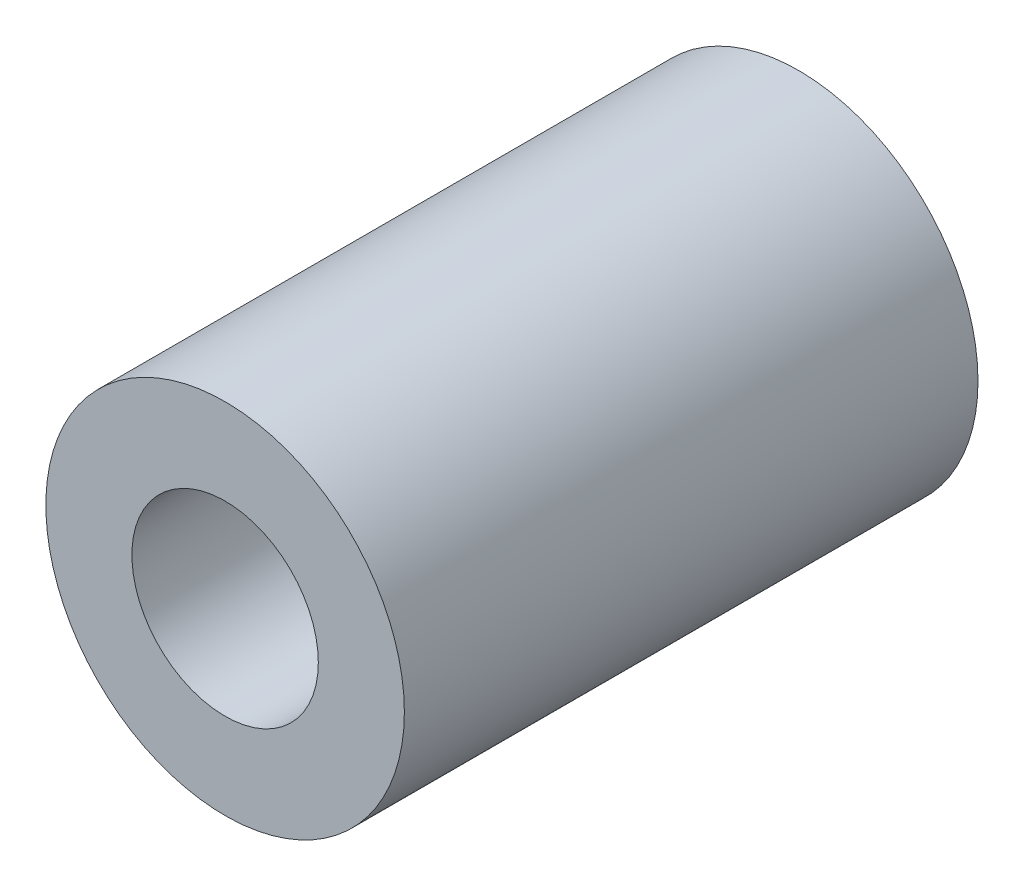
ISO-10303-21;
HEADER;
FILE_DESCRIPTION(('STEP AP214'),'2;1');
FILE_NAME('part.step','',(''),(''),'','','');
FILE_SCHEMA(('AUTOMOTIVE_DESIGN { 1 0 10303 214 1 1 1 1 }'));
ENDSEC;
DATA;
#1=APPLICATION_CONTEXT('core data for automotive mechanical design processes');
#2=APPLICATION_PROTOCOL_DEFINITION('international standard','automotive_design',2000,#1);
#3=PRODUCT_CONTEXT('',#1,'mechanical');
#4=PRODUCT('Part','Part','',(#3));
#5=PRODUCT_RELATED_PRODUCT_CATEGORY('part','',(#4));
#6=PRODUCT_DEFINITION_FORMATION('','',#4);
#7=PRODUCT_DEFINITION_CONTEXT('part definition',#1,'design');
#8=PRODUCT_DEFINITION('design','',#6,#7);
#9=PRODUCT_DEFINITION_SHAPE('','',#8);
#10=(LENGTH_UNIT() NAMED_UNIT(*) SI_UNIT(.MILLI.,.METRE.));
#11=(NAMED_UNIT(*) PLANE_ANGLE_UNIT() SI_UNIT($,.RADIAN.));
#12=(NAMED_UNIT(*) SI_UNIT($,.STERADIAN.) SOLID_ANGLE_UNIT());
#13=UNCERTAINTY_MEASURE_WITH_UNIT(LENGTH_MEASURE(1.E-05),#10,'distance_accuracy_value','');
#14=(GEOMETRIC_REPRESENTATION_CONTEXT(3) GLOBAL_UNCERTAINTY_ASSIGNED_CONTEXT((#13)) GLOBAL_UNIT_ASSIGNED_CONTEXT((#10,
#11,#12)) REPRESENTATION_CONTEXT('',''));
#15=CARTESIAN_POINT('',(0.,0.,0.));
#16=DIRECTION('',(0.,0.,1.));
#17=DIRECTION('',(1.,0.,0.));
#18=AXIS2_PLACEMENT_3D('',#15,#16,#17);
#19=CARTESIAN_POINT('',(13.,0.,35.));
#20=DIRECTION('',(0.,0.,-1.));
#21=DIRECTION('',(-1.,0.,0.));
#22=AXIS2_PLACEMENT_3D('',#19,#20,#21);
#23=PLANE('',#22);
#24=CARTESIAN_POINT('',(0.,0.,35.));
#25=DIRECTION('',(0.,0.,1.));
#26=DIRECTION('',(1.,0.,0.));
#27=AXIS2_PLACEMENT_3D('',#24,#25,#26);
#28=CIRCLE('',#27,9.);
#29=CARTESIAN_POINT('',(9.,0.,35.));
#30=VERTEX_POINT('',#29);
#31=EDGE_CURVE('E8',#30,#30,#28,.T.);
#32=ORIENTED_EDGE('',*,*,#31,.F.);
#33=EDGE_LOOP('',(#32));
#34=FACE_BOUND('',#33,.T.);
#35=CARTESIAN_POINT('',(0.,0.,35.));
#36=DIRECTION('',(0.,0.,1.));
#37=DIRECTION('',(1.,0.,0.));
#38=AXIS2_PLACEMENT_3D('',#35,#36,#37);
#39=CIRCLE('',#38,13.);
#40=CARTESIAN_POINT('',(13.,0.,35.));
#41=VERTEX_POINT('',#40);
#42=EDGE_CURVE('E34',#41,#41,#39,.T.);
#43=ORIENTED_EDGE('',*,*,#42,.T.);
#44=EDGE_LOOP('',(#43));
#45=FACE_BOUND('',#44,.T.);
#46=ADVANCED_FACE('F12',(#34,#45),#23,.F.);
#47=CARTESIAN_POINT('',(0.,0.,40.));
#48=DIRECTION('',(0.,0.,1.));
#49=DIRECTION('',(1.,0.,0.));
#50=AXIS2_PLACEMENT_3D('',#47,#48,#49);
#51=CYLINDRICAL_SURFACE('',#50,9.);
#52=CARTESIAN_POINT('',(0.,0.,0.));
#53=DIRECTION('',(0.,0.,1.));
#54=DIRECTION('',(1.,0.,0.));
#55=AXIS2_PLACEMENT_3D('',#52,#53,#54);
#56=CIRCLE('',#55,9.);
#57=CARTESIAN_POINT('',(9.,0.,0.));
#58=VERTEX_POINT('',#57);
#59=EDGE_CURVE('E18',#58,#58,#56,.T.);
#60=ORIENTED_EDGE('',*,*,#59,.F.);
#61=EDGE_LOOP('',(#60));
#62=FACE_BOUND('',#61,.T.);
#63=ORIENTED_EDGE('',*,*,#31,.T.);
#64=EDGE_LOOP('',(#63));
#65=FACE_BOUND('',#64,.T.);
#66=ADVANCED_FACE('F59',(#62,#65),#51,.F.);
#67=CARTESIAN_POINT('',(9.,0.,0.));
#68=DIRECTION('',(0.,0.,1.));
#69=DIRECTION('',(1.,0.,0.));
#70=AXIS2_PLACEMENT_3D('',#67,#68,#69);
#71=PLANE('',#70);
#72=CARTESIAN_POINT('',(0.,0.,0.));
#73=DIRECTION('',(0.,0.,1.));
#74=DIRECTION('',(1.,0.,0.));
#75=AXIS2_PLACEMENT_3D('',#72,#73,#74);
#76=CIRCLE('',#75,25.);
#77=CARTESIAN_POINT('',(25.,0.,0.));
#78=VERTEX_POINT('',#77);
#79=EDGE_CURVE('E22',#78,#78,#76,.T.);
#80=ORIENTED_EDGE('',*,*,#79,.F.);
#81=EDGE_LOOP('',(#80));
#82=FACE_BOUND('',#81,.T.);
#83=ORIENTED_EDGE('',*,*,#59,.T.);
#84=EDGE_LOOP('',(#83));
#85=FACE_BOUND('',#84,.T.);
#86=ADVANCED_FACE('F54',(#82,#85),#71,.F.);
#87=CARTESIAN_POINT('',(0.,0.,40.));
#88=DIRECTION('',(0.,0.,1.));
#89=DIRECTION('',(1.,0.,0.));
#90=AXIS2_PLACEMENT_3D('',#87,#88,#89);
#91=CYLINDRICAL_SURFACE('',#90,25.);
#92=CARTESIAN_POINT('',(0.,0.,80.));
#93=DIRECTION('',(0.,0.,1.));
#94=DIRECTION('',(1.,0.,0.));
#95=AXIS2_PLACEMENT_3D('',#92,#93,#94);
#96=CIRCLE('',#95,25.);
#97=CARTESIAN_POINT('',(25.,0.,80.));
#98=VERTEX_POINT('',#97);
#99=EDGE_CURVE('E26',#98,#98,#96,.T.);
#100=ORIENTED_EDGE('',*,*,#99,.F.);
#101=EDGE_LOOP('',(#100));
#102=FACE_BOUND('',#101,.T.);
#103=ORIENTED_EDGE('',*,*,#79,.T.);
#104=EDGE_LOOP('',(#103));
#105=FACE_BOUND('',#104,.T.);
#106=ADVANCED_FACE('F48',(#102,#105),#91,.T.);
#107=CARTESIAN_POINT('',(25.,0.,80.));
#108=DIRECTION('',(0.,0.,-1.));
#109=DIRECTION('',(-1.,0.,0.));
#110=AXIS2_PLACEMENT_3D('',#107,#108,#109);
#111=PLANE('',#110);
#112=CARTESIAN_POINT('',(0.,0.,80.));
#113=DIRECTION('',(0.,0.,1.));
#114=DIRECTION('',(1.,0.,0.));
#115=AXIS2_PLACEMENT_3D('',#112,#113,#114);
#116=CIRCLE('',#115,13.);
#117=CARTESIAN_POINT('',(13.,0.,80.));
#118=VERTEX_POINT('',#117);
#119=EDGE_CURVE('E31',#118,#118,#116,.T.);
#120=ORIENTED_EDGE('',*,*,#119,.F.);
#121=EDGE_LOOP('',(#120));
#122=FACE_BOUND('',#121,.T.);
#123=ORIENTED_EDGE('',*,*,#99,.T.);
#124=EDGE_LOOP('',(#123));
#125=FACE_BOUND('',#124,.T.);
#126=ADVANCED_FACE('F42',(#122,#125),#111,.F.);
#127=CARTESIAN_POINT('',(0.,0.,40.));
#128=DIRECTION('',(0.,0.,1.));
#129=DIRECTION('',(1.,0.,0.));
#130=AXIS2_PLACEMENT_3D('',#127,#128,#129);
#131=CYLINDRICAL_SURFACE('',#130,13.);
#132=ORIENTED_EDGE('',*,*,#42,.F.);
#133=EDGE_LOOP('',(#132));
#134=FACE_BOUND('',#133,.T.);
#135=ORIENTED_EDGE('',*,*,#119,.T.);
#136=EDGE_LOOP('',(#135));
#137=FACE_BOUND('',#136,.T.);
#138=ADVANCED_FACE('F39',(#134,#137),#131,.F.);
#139=CLOSED_SHELL('',(#46,#66,#86,#106,#126,#138));
#140=MANIFOLD_SOLID_BREP('B1',#139);
#141=ADVANCED_BREP_SHAPE_REPRESENTATION('',(#18,#140),#14);
#142=SHAPE_DEFINITION_REPRESENTATION(#9,#141);
ENDSEC;
END-ISO-10303-21;
